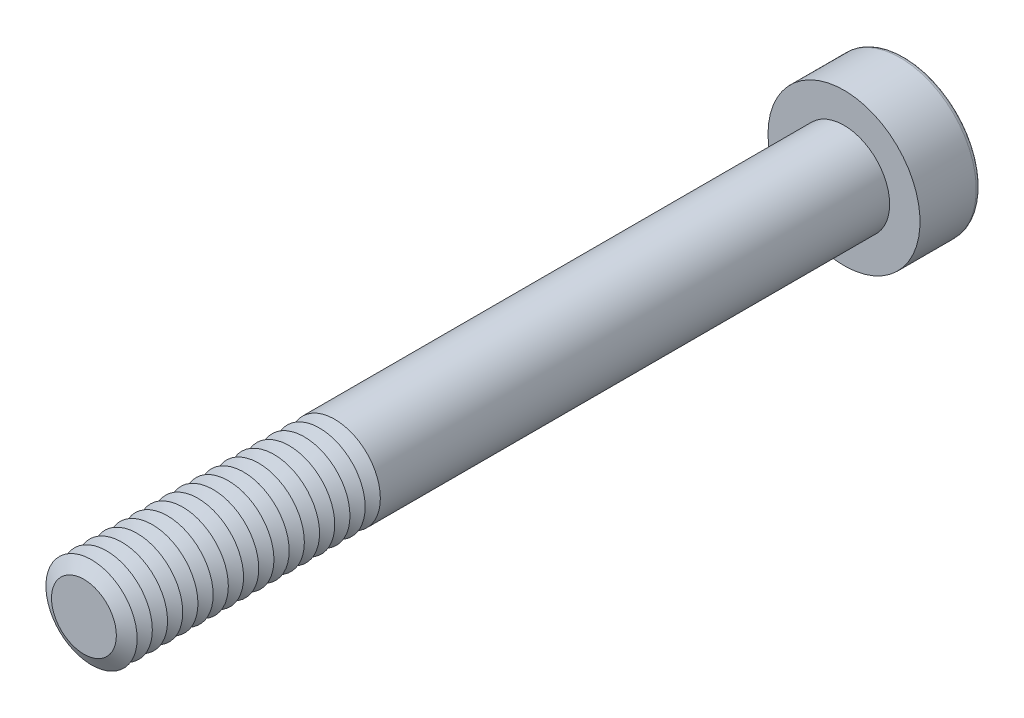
from build123d import *

# Parameters (mm, degrees)
SKETCH1_R           = 3
BOSS_EXTRUDE1_DEPTH = 50
SKETCH2_R           = 5
BOSS_EXTRUDE2_DEPTH = 4
CUT_EXTRUDE1_DEPTH  = 3
FILLET1_R           = 0.3
LPATTERN1_COUNT     = 17
LPATTERN1_PITCH     = 1


with BuildPart() as part:
    # Sketch1 → Boss-Extrude1 (new body)
    with BuildSketch(Plane.XY):
        Circle(SKETCH1_R)
    extrude(amount=BOSS_EXTRUDE1_DEPTH)

    # Sketch2 → Boss-Extrude2 (add)
    with BuildSketch(Plane(origin=(0, 0, 0), x_dir=(-1, 0, 0), z_dir=(0, 0, -1))):
        Circle(SKETCH2_R)
    extrude(amount=BOSS_EXTRUDE2_DEPTH)

    # Sketch3 → Cut-Extrude1 (cut)
    with BuildSketch(Plane(origin=(0, 0, -4), x_dir=(-1, 0, 0), z_dir=(0, 0, -1))):
        Polygon((-1.154700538, 2), (-2.309401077, 0), (-1.154700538, -2), (1.154700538, -2), (2.309401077, 0), (1.154700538, 2), align=None)
    extrude(amount=-CUT_EXTRUDE1_DEPTH, mode=Mode.SUBTRACT)

    # Fillet1
    fillet1_edges = [part.edges().sort_by_distance(p)[0] for p in [
        (5, 0, -4),
    ]]
    fillet(fillet1_edges, radius=FILLET1_R)

    # Cut-Extrude2 cone 1 section (on through the dimple's axis) → Cut-Extrude2 (revolve, cut)
    with BuildSketch(Plane(origin=(0, 0, -1), x_dir=(0, 1, 0), z_dir=(1, 0, 0))):
        Polygon((0, 0), (2, 0), (0, 1.154700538), align=None)
    revolve(axis=Axis((0, 0, -1), (0, 0, 1)), mode=Mode.SUBTRACT)

    # Cut-Extrude3 cone 1 section (on through the dimple's axis) → Cut-Extrude3 (revolve, cut)
    with BuildSketch(Plane(origin=(0, 0, -4), x_dir=(0, 1, 0), z_dir=(1, 0, 0))):
        Polygon((0, 0), (2.309401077, 0), (0, 0.618802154), align=None)
    revolve(axis=Axis((0, 0, -4), (0, 0, 1)), mode=Mode.SUBTRACT)

    # Sketch7 → Cut-Revolve1 (revolve, cut)
    with BuildSketch(Plane(origin=(0, 0, 0), x_dir=(0, 0, -1), z_dir=(1, 0, 0)), mode=Mode.PRIVATE) as cut_revolve1_sk:
        Polygon((-50, 2.133974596), (-49.5, 3), (-50.5, 3), align=None)
    cut_revolve1 = revolve(cut_revolve1_sk.sketch.rotate(Axis((0, 0, 50), (0, 0, -1)), 90), axis=Axis((0, 0, 50), (0, 0, -1)), mode=Mode.SUBTRACT)

    # LPattern1: Cut-Revolve1 ×17
    with Locations(*[(0, 0, -i * LPATTERN1_PITCH) for i in range(1, LPATTERN1_COUNT)]):
        add(cut_revolve1, mode=Mode.SUBTRACT)


solid = part.part
